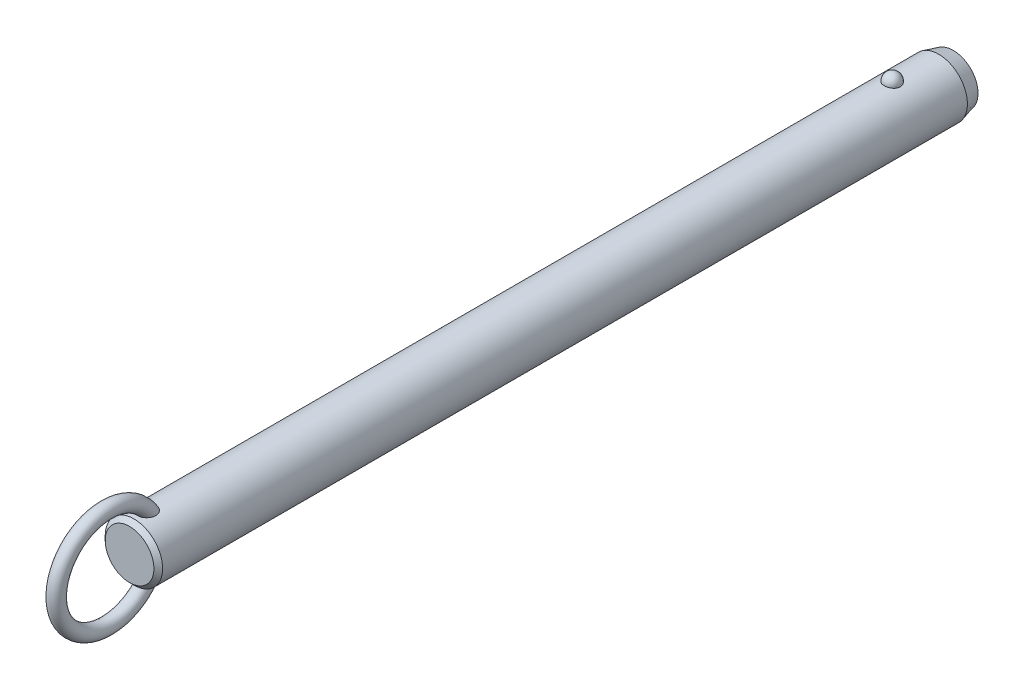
ISO-10303-21;
HEADER;
FILE_DESCRIPTION(('STEP AP214'),'2;1');
FILE_NAME('part.step','',(''),(''),'','','');
FILE_SCHEMA(('AUTOMOTIVE_DESIGN { 1 0 10303 214 1 1 1 1 }'));
ENDSEC;
DATA;
#1=APPLICATION_CONTEXT('core data for automotive mechanical design processes');
#2=APPLICATION_PROTOCOL_DEFINITION('international standard','automotive_design',2000,#1);
#3=PRODUCT_CONTEXT('',#1,'mechanical');
#4=PRODUCT('Part','Part','',(#3));
#5=PRODUCT_RELATED_PRODUCT_CATEGORY('part','',(#4));
#6=PRODUCT_DEFINITION_FORMATION('','',#4);
#7=PRODUCT_DEFINITION_CONTEXT('part definition',#1,'design');
#8=PRODUCT_DEFINITION('design','',#6,#7);
#9=PRODUCT_DEFINITION_SHAPE('','',#8);
#10=(LENGTH_UNIT() NAMED_UNIT(*) SI_UNIT(.MILLI.,.METRE.));
#11=(NAMED_UNIT(*) PLANE_ANGLE_UNIT() SI_UNIT($,.RADIAN.));
#12=(NAMED_UNIT(*) SI_UNIT($,.STERADIAN.) SOLID_ANGLE_UNIT());
#13=UNCERTAINTY_MEASURE_WITH_UNIT(LENGTH_MEASURE(1.E-05),#10,'distance_accuracy_value','');
#14=(GEOMETRIC_REPRESENTATION_CONTEXT(3) GLOBAL_UNCERTAINTY_ASSIGNED_CONTEXT((#13)) GLOBAL_UNIT_ASSIGNED_CONTEXT((#10,
#11,#12)) REPRESENTATION_CONTEXT('',''));
#15=CARTESIAN_POINT('',(0.,0.,0.));
#16=DIRECTION('',(0.,0.,1.));
#17=DIRECTION('',(1.,0.,0.));
#18=AXIS2_PLACEMENT_3D('',#15,#16,#17);
#19=CARTESIAN_POINT('',(0.,0.,198.1));
#20=DIRECTION('',(0.,0.,-1.));
#21=DIRECTION('',(-1.,0.,0.));
#22=AXIS2_PLACEMENT_3D('',#19,#20,#21);
#23=CYLINDRICAL_SURFACE('',#22,7.9);
#24=CARTESIAN_POINT('',(2.1785689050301,7.59367088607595,-2.20000000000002));
#25=CARTESIAN_POINT('',(2.17856679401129,7.59367269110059,-2.07701843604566));
#26=CARTESIAN_POINT('',(2.16853481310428,7.59657145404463,-1.95401006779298));
#27=CARTESIAN_POINT('',(2.12864689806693,7.607843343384,-1.71147811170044));
#28=CARTESIAN_POINT('',(2.09878338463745,7.61621856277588,-1.5919558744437));
#29=CARTESIAN_POINT('',(2.0199931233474,7.63749180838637,-1.35985638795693));
#30=CARTESIAN_POINT('',(1.97107475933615,7.6503878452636,-1.24727610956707));
#31=CARTESIAN_POINT('',(1.85539377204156,7.67926115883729,-1.03213234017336));
#32=CARTESIAN_POINT('',(1.78863158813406,7.69523835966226,-0.929568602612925));
#33=CARTESIAN_POINT('',(1.63856494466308,7.7285848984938,-0.73678633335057));
#34=CARTESIAN_POINT('',(1.55518140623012,7.7459606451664,-0.646630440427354));
#35=CARTESIAN_POINT('',(1.37422937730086,7.78009978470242,-0.481747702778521));
#36=CARTESIAN_POINT('',(1.27666086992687,7.79686317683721,-0.407020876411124));
#37=CARTESIAN_POINT('',(1.07024728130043,7.82786153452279,-0.275278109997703));
#38=CARTESIAN_POINT('',(0.961434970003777,7.84210353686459,-0.218212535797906));
#39=CARTESIAN_POINT('',(0.735351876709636,7.86652194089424,-0.123146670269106));
#40=CARTESIAN_POINT('',(0.618082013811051,7.87669878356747,-0.0851443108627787));
#41=CARTESIAN_POINT('',(0.380637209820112,7.89170521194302,-0.0298158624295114));
#42=CARTESIAN_POINT('',(0.260550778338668,7.89662650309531,-0.0121347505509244));
#43=CARTESIAN_POINT('',(0.0190117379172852,7.90090003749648,0.00324379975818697));
#44=CARTESIAN_POINT('',(-0.102440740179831,7.90025280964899,0.000943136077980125));
#45=CARTESIAN_POINT('',(-0.341452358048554,7.89351056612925,-0.0233955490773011));
#46=CARTESIAN_POINT('',(-0.459042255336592,7.88749257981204,-0.0451545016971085));
#47=CARTESIAN_POINT('',(-0.688796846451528,7.87075812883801,-0.107408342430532));
#48=CARTESIAN_POINT('',(-0.800961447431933,7.86004158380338,-0.14790355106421));
#49=CARTESIAN_POINT('',(-1.01743634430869,7.83497131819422,-0.246799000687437));
#50=CARTESIAN_POINT('',(-1.12169791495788,7.82059709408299,-0.305300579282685));
#51=CARTESIAN_POINT('',(-1.31891765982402,7.78976470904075,-0.43854939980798));
#52=CARTESIAN_POINT('',(-1.41187469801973,7.77330633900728,-0.513298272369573));
#53=CARTESIAN_POINT('',(-1.58577142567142,7.73972434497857,-0.678622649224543));
#54=CARTESIAN_POINT('',(-1.66645140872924,7.72259402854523,-0.769470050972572));
#55=CARTESIAN_POINT('',(-1.81161503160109,7.68983776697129,-0.963538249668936));
#56=CARTESIAN_POINT('',(-1.87609753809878,7.6742119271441,-1.0667599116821));
#57=CARTESIAN_POINT('',(-1.98790138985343,7.6460202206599,-1.28401170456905));
#58=CARTESIAN_POINT('',(-2.03501994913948,7.63349104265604,-1.39815107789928));
#59=CARTESIAN_POINT('',(-2.10986724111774,7.6131449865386,-1.6330178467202));
#60=CARTESIAN_POINT('',(-2.1375965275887,7.60532797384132,-1.75374505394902));
#61=CARTESIAN_POINT('',(-2.17289256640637,7.5953195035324,-1.99782562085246));
#62=CARTESIAN_POINT('',(-2.18054294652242,7.59310471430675,-2.12116592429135));
#63=CARTESIAN_POINT('',(-2.17572919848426,7.59448538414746,-2.36741799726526));
#64=CARTESIAN_POINT('',(-2.1632656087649,7.59808068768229,-2.49032977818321));
#65=CARTESIAN_POINT('',(-2.11865035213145,7.61064035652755,-2.73161015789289));
#66=CARTESIAN_POINT('',(-2.08659579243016,7.61957823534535,-2.84999812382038));
#67=CARTESIAN_POINT('',(-2.00367799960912,7.64179982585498,-3.07955956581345));
#68=CARTESIAN_POINT('',(-1.9528140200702,7.65508371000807,-3.19073275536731));
#69=CARTESIAN_POINT('',(-1.83321113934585,7.68460381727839,-3.40337899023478));
#70=CARTESIAN_POINT('',(-1.76437735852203,7.70085556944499,-3.5047965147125));
#71=CARTESIAN_POINT('',(-1.61069526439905,7.73445734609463,-3.69446912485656));
#72=CARTESIAN_POINT('',(-1.52584634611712,7.75180741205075,-3.78272371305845));
#73=CARTESIAN_POINT('',(-1.34198059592,7.78574608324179,-3.94393987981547));
#74=CARTESIAN_POINT('',(-1.24291308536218,7.80233167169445,-4.01684434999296));
#75=CARTESIAN_POINT('',(-1.03352039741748,7.83281625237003,-4.14489386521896));
#76=CARTESIAN_POINT('',(-0.92319600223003,7.84671543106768,-4.20004014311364));
#77=CARTESIAN_POINT('',(-0.695822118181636,7.87011575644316,-4.29042017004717));
#78=CARTESIAN_POINT('',(-0.578872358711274,7.87966903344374,-4.32589112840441));
#79=CARTESIAN_POINT('',(-0.340410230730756,7.8935652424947,-4.37692226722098));
#80=CARTESIAN_POINT('',(-0.218898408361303,7.89790879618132,-4.39248482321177));
#81=CARTESIAN_POINT('',(0.0228107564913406,7.90087453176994,-4.40314405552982));
#82=CARTESIAN_POINT('',(0.142990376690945,7.89960185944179,-4.39861683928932));
#83=CARTESIAN_POINT('',(0.380829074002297,7.89171262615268,-4.37008293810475));
#84=CARTESIAN_POINT('',(0.498488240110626,7.8850962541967,-4.34607694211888));
#85=CARTESIAN_POINT('',(0.727535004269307,7.86726442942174,-4.27939317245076));
#86=CARTESIAN_POINT('',(0.838944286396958,7.85606616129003,-4.23678512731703));
#87=CARTESIAN_POINT('',(1.05295421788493,7.83025654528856,-4.13408348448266));
#88=CARTESIAN_POINT('',(1.15555431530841,7.81564498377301,-4.07398879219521));
#89=CARTESIAN_POINT('',(1.35076763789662,7.7843022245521,-3.93687432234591));
#90=CARTESIAN_POINT('',(1.4432046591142,7.76754209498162,-3.85961036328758));
#91=CARTESIAN_POINT('',(1.6139111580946,7.73387857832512,-3.69076949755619));
#92=CARTESIAN_POINT('',(1.6921781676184,7.71697516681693,-3.59919010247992));
#93=CARTESIAN_POINT('',(1.83380875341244,7.6845643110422,-3.40247278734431));
#94=CARTESIAN_POINT('',(1.89689280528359,7.66908588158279,-3.29712873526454));
#95=CARTESIAN_POINT('',(2.0047823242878,7.64159441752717,-3.07707931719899));
#96=CARTESIAN_POINT('',(2.0495945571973,7.62958010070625,-2.96237743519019));
#97=CARTESIAN_POINT('',(2.11580183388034,7.61146617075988,-2.74040519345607));
#98=CARTESIAN_POINT('',(2.13929812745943,7.60484503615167,-2.63379846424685));
#99=CARTESIAN_POINT('',(2.17068242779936,7.59594664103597,-2.4181348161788));
#100=CARTESIAN_POINT('',(2.17857077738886,7.59366928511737,-2.30907795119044));
#101=CARTESIAN_POINT('',(2.1785689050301,7.59367088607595,-2.20000000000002));
#102=B_SPLINE_CURVE_WITH_KNOTS('',3,(#24,#25,#26,#27,#28,#29,#30,#31,#32,#33,#34,#35,#36,#37,
#38,#39,#40,#41,#42,#43,#44,#45,#46,#47,#48,#49,#50,#51,#52,#53,#54,#55,#56,#57,#58,#59,#60,#61,
#62,#63,#64,#65,#66,#67,#68,#69,#70,#71,#72,#73,#74,#75,#76,#77,#78,#79,#80,#81,#82,#83,#84,#85,
#86,#87,#88,#89,#90,#91,#92,#93,#94,#95,#96,#97,#98,#99,#100,#101),.UNSPECIFIED.,.T.,.F.,(4,2,2,
2,2,2,2,2,2,2,2,2,2,2,2,2,2,2,2,2,2,2,2,2,2,2,2,2,2,2,2,2,2,2,2,2,2,2,4),(0.,0.368552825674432,
0.737246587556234,1.10577831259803,1.4743009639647,1.8446206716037,2.21494081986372,
2.5842105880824,2.95344028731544,3.31611630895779,3.67875788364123,4.03628044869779,
4.39380913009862,4.75338791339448,5.11300280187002,5.47939989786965,5.8458226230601,
6.21639834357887,6.58696347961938,6.95598276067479,7.32499216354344,7.69218715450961,
8.0593967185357,8.42858578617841,8.79778880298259,9.16834203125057,9.5388695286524,
9.90482699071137,10.2707407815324,10.6298333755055,10.9889132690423,11.3466585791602,
11.7044262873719,12.0676511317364,12.4309391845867,12.8004764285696,13.1698767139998,
13.4967701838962,13.8236564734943),.UNSPECIFIED.);
#103=CARTESIAN_POINT('',(2.1785689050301,7.59367088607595,-2.20000000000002));
#104=VERTEX_POINT('',#103);
#105=EDGE_CURVE('E41',#104,#104,#102,.T.);
#106=ORIENTED_EDGE('',*,*,#105,.T.);
#107=EDGE_LOOP('',(#106));
#108=FACE_BOUND('',#107,.T.);
#109=CARTESIAN_POINT('',(0.,0.,206.42));
#110=DIRECTION('',(0.,0.,1.));
#111=DIRECTION('',(1.,0.,0.));
#112=AXIS2_PLACEMENT_3D('',#109,#110,#111);
#113=CIRCLE('',#112,7.9);
#114=CARTESIAN_POINT('',(7.9,0.,206.42));
#115=VERTEX_POINT('',#114);
#116=EDGE_CURVE('E10',#115,#115,#113,.F.);
#117=ORIENTED_EDGE('',*,*,#116,.T.);
#118=EDGE_LOOP('',(#117));
#119=FACE_BOUND('',#118,.T.);
#120=CARTESIAN_POINT('',(-0.630969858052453,-7.87476203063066,200.312432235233));
#121=CARTESIAN_POINT('',(-0.734180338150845,-7.86648998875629,200.347285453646));
#122=CARTESIAN_POINT('',(-0.834476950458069,-7.85639291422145,200.390816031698));
#123=CARTESIAN_POINT('',(-1.0262035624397,-7.83366343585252,200.494094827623));
#124=CARTESIAN_POINT('',(-1.1176141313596,-7.82102565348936,200.553877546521));
#125=CARTESIAN_POINT('',(-1.28877277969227,-7.79464922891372,200.687839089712));
#126=CARTESIAN_POINT('',(-1.36854014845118,-7.78091246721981,200.761993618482));
#127=CARTESIAN_POINT('',(-1.5146152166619,-7.75380398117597,200.922494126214));
#128=CARTESIAN_POINT('',(-1.58092966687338,-7.74043207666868,201.008833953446));
#129=CARTESIAN_POINT('',(-1.70019064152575,-7.7151252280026,201.192978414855));
#130=CARTESIAN_POINT('',(-1.75284037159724,-7.70322473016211,201.290979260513));
#131=CARTESIAN_POINT('',(-1.84263464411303,-7.68224112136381,201.494102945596));
#132=CARTESIAN_POINT('',(-1.87977299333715,-7.6731591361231,201.599228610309));
#133=CARTESIAN_POINT('',(-1.94152728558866,-7.65777930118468,201.823284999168));
#134=CARTESIAN_POINT('',(-1.96475471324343,-7.65179654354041,201.942616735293));
#135=CARTESIAN_POINT('',(-1.99449499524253,-7.64409642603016,202.18342986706));
#136=CARTESIAN_POINT('',(-2.0010005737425,-7.64238092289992,202.304912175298));
#137=CARTESIAN_POINT('',(-1.99856014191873,-7.64302120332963,202.568340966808));
#138=CARTESIAN_POINT('',(-1.98680021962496,-7.64611845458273,202.71025654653));
#139=CARTESIAN_POINT('',(-1.94457772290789,-7.65696186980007,202.991118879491));
#140=CARTESIAN_POINT('',(-1.91409393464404,-7.66471330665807,203.130062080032));
#141=CARTESIAN_POINT('',(-1.82768670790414,-7.68582947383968,203.431939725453));
#142=CARTESIAN_POINT('',(-1.76772963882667,-7.70003779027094,203.593686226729));
#143=CARTESIAN_POINT('',(-1.65998501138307,-7.72371550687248,203.827695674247));
#144=CARTESIAN_POINT('',(-1.621079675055,-7.73200670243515,203.904297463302));
#145=CARTESIAN_POINT('',(-1.53727726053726,-7.74910377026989,204.054079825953));
#146=CARTESIAN_POINT('',(-1.49238215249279,-7.75790947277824,204.127261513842));
#147=CARTESIAN_POINT('',(-1.37397050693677,-7.77993338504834,204.30288382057));
#148=CARTESIAN_POINT('',(-1.29690364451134,-7.79328473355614,204.402955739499));
#149=CARTESIAN_POINT('',(-1.12885487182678,-7.81939266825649,204.590714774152));
#150=CARTESIAN_POINT('',(-1.03789926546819,-7.83215032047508,204.678424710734));
#151=CARTESIAN_POINT('',(-0.869532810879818,-7.85231710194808,204.813414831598));
#152=CARTESIAN_POINT('',(-0.795716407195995,-7.86021093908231,204.865076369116));
#153=CARTESIAN_POINT('',(-0.640813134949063,-7.87434920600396,204.956381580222));
#154=CARTESIAN_POINT('',(-0.559737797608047,-7.88059619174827,204.99604389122));
#155=CARTESIAN_POINT('',(-0.406456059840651,-7.88984116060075,205.054300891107));
#156=CARTESIAN_POINT('',(-0.335227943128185,-7.89321892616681,205.075384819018));
#157=CARTESIAN_POINT('',(-0.190193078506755,-7.89804235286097,205.10541418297));
#158=CARTESIAN_POINT('',(-0.116388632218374,-7.89948969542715,205.114370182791));
#159=CARTESIAN_POINT('',(0.0318414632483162,-7.90028409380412,205.119291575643));
#160=CARTESIAN_POINT('',(0.106268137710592,-7.89962640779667,205.115227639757));
#161=CARTESIAN_POINT('',(0.253290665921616,-7.8962818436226,205.094461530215));
#162=CARTESIAN_POINT('',(0.325885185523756,-7.8935935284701,205.077750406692));
#163=CARTESIAN_POINT('',(0.481441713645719,-7.88577340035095,205.028738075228));
#164=CARTESIAN_POINT('',(0.563611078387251,-7.88026321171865,204.994005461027));
#165=CARTESIAN_POINT('',(0.721129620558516,-7.86741729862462,204.911796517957));
#166=CARTESIAN_POINT('',(0.79646633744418,-7.86007832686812,204.864297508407));
#167=CARTESIAN_POINT('',(0.971456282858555,-7.84073285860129,204.736513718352));
#168=CARTESIAN_POINT('',(1.06719686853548,-7.82809461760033,204.651004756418));
#169=CARTESIAN_POINT('',(1.24418921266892,-7.80192439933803,204.466232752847));
#170=CARTESIAN_POINT('',(1.32540832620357,-7.78839049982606,204.366939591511));
#171=CARTESIAN_POINT('',(1.45199971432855,-7.76559693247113,204.189576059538));
#172=CARTESIAN_POINT('',(1.50085649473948,-7.75626094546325,204.113954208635));
#173=CARTESIAN_POINT('',(1.59197749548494,-7.73807279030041,203.958742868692));
#174=CARTESIAN_POINT('',(1.63423919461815,-7.72922080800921,203.879151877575));
#175=CARTESIAN_POINT('',(1.71222612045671,-7.71231959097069,203.716664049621));
#176=CARTESIAN_POINT('',(1.74794516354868,-7.70427111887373,203.633764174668));
#177=CARTESIAN_POINT('',(1.81270113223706,-7.68929240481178,203.465296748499));
#178=CARTESIAN_POINT('',(1.84173789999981,-7.68236218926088,203.379729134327));
#179=CARTESIAN_POINT('',(1.89322698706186,-7.6698375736,203.20528702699));
#180=CARTESIAN_POINT('',(1.91558744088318,-7.66426199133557,203.116383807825));
#181=CARTESIAN_POINT('',(1.95281367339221,-7.65485915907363,202.936969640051));
#182=CARTESIAN_POINT('',(1.96767946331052,-7.65103190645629,202.846458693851));
#183=CARTESIAN_POINT('',(2.0002145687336,-7.64262981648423,202.573732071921));
#184=CARTESIAN_POINT('',(2.00600691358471,-7.6410871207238,202.389709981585));
#185=CARTESIAN_POINT('',(1.98445334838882,-7.64669564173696,202.076501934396));
#186=CARTESIAN_POINT('',(1.96607186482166,-7.65149688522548,201.946618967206));
#187=CARTESIAN_POINT('',(1.90884967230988,-7.66597624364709,201.691632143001));
#188=CARTESIAN_POINT('',(1.87002101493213,-7.67565148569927,201.566525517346));
#189=CARTESIAN_POINT('',(1.77063986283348,-7.69918471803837,201.32454013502));
#190=CARTESIAN_POINT('',(1.70993724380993,-7.71307150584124,201.207725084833));
#191=CARTESIAN_POINT('',(1.56733070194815,-7.74330306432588,200.988144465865));
#192=CARTESIAN_POINT('',(1.48543692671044,-7.75964665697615,200.885372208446));
#193=CARTESIAN_POINT('',(1.31346177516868,-7.79047523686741,200.709380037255));
#194=CARTESIAN_POINT('',(1.22547278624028,-7.80495298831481,200.634106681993));
#195=CARTESIAN_POINT('',(1.03724352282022,-7.83218597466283,200.500486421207));
#196=CARTESIAN_POINT('',(0.93700840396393,-7.84494192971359,200.442132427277));
#197=CARTESIAN_POINT('',(0.733599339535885,-7.86649045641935,200.347027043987));
#198=CARTESIAN_POINT('',(0.630941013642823,-7.87547134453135,200.309210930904));
#199=CARTESIAN_POINT('',(0.420465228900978,-7.88950708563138,200.251116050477));
#200=CARTESIAN_POINT('',(0.312645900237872,-7.89456050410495,200.23084369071));
#201=CARTESIAN_POINT('',(0.0960869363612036,-7.9001518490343,200.208455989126));
#202=CARTESIAN_POINT('',(-0.0126341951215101,-7.90073226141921,200.206169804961));
#203=CARTESIAN_POINT('',(-0.228766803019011,-7.89742350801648,200.219367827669));
#204=CARTESIAN_POINT('',(-0.336180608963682,-7.89354403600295,200.234813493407));
#205=CARTESIAN_POINT('',(-0.473410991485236,-7.88586871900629,200.266217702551));
#206=CARTESIAN_POINT('',(-0.50525779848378,-7.88388984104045,200.274354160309));
#207=CARTESIAN_POINT('',(-0.56848128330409,-7.87958326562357,200.292208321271));
#208=CARTESIAN_POINT('',(-0.59985795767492,-7.87725556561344,200.301926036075));
#209=CARTESIAN_POINT('',(-0.630969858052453,-7.87476203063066,200.312432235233));
#210=B_SPLINE_CURVE_WITH_KNOTS('',3,(#120,#121,#122,#123,#124,#125,#126,#127,#128,#129,#130,
#131,#132,#133,#134,#135,#136,#137,#138,#139,#140,#141,#142,#143,#144,#145,#146,#147,#148,#149,
#150,#151,#152,#153,#154,#155,#156,#157,#158,#159,#160,#161,#162,#163,#164,#165,#166,#167,#168,
#169,#170,#171,#172,#173,#174,#175,#176,#177,#178,#179,#180,#181,#182,#183,#184,#185,#186,#187,
#188,#189,#190,#191,#192,#193,#194,#195,#196,#197,#198,#199,#200,#201,#202,#203,#204,#205,#206,
#207,#208,#209),.UNSPECIFIED.,.T.,.F.,(4,2,2,2,2,2,2,2,2,2,2,2,2,2,2,2,2,2,2,2,2,2,2,2,2,2,2,2,
2,2,2,2,2,2,2,2,2,2,2,2,2,2,2,2,4),(0.,0.327622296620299,0.655945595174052,0.983718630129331,
1.31132677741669,1.64554655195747,1.97989964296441,2.34365728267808,2.70757317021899,
3.13333684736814,3.55958380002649,4.07655306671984,4.33527897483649,4.59391999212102,
4.97382437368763,5.353017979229,5.62348245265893,5.89352465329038,6.11565959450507,
6.33760092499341,6.56004255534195,6.78264174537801,7.04930844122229,7.31645206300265,
7.70130871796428,8.08701995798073,8.35824509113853,8.6295736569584,8.9011573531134,
9.17274746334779,9.44791855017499,9.72308922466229,10.2715298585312,10.6638393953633,
11.0559179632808,11.4507403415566,11.8453740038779,12.1936425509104,12.5417649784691,
12.8695063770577,13.1973674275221,13.5221104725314,13.8461490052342,13.9449071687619,
14.0436660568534),.UNSPECIFIED.);
#211=CARTESIAN_POINT('',(-0.630969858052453,-7.87476203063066,200.312432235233));
#212=VERTEX_POINT('',#211);
#213=EDGE_CURVE('E60',#212,#212,#210,.T.);
#214=ORIENTED_EDGE('',*,*,#213,.T.);
#215=EDGE_LOOP('',(#214));
#216=FACE_BOUND('',#215,.T.);
#217=CARTESIAN_POINT('',(-0.630969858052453,7.87476203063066,200.312432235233));
#218=CARTESIAN_POINT('',(-0.528918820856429,7.88293636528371,200.277979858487));
#219=CARTESIAN_POINT('',(-0.423745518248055,7.88934810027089,200.251915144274));
#220=CARTESIAN_POINT('',(-0.210236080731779,7.8979273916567,200.217282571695));
#221=CARTESIAN_POINT('',(-0.10189380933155,7.90008607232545,200.208751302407));
#222=CARTESIAN_POINT('',(0.11466056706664,7.89990877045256,200.209457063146));
#223=CARTESIAN_POINT('',(0.222872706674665,7.89757640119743,200.21867980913));
#224=CARTESIAN_POINT('',(0.436107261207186,7.88867538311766,200.254652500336));
#225=CARTESIAN_POINT('',(0.54113114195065,7.8821087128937,200.28139425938));
#226=CARTESIAN_POINT('',(0.745085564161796,7.86545130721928,200.351756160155));
#227=CARTESIAN_POINT('',(0.844015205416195,7.85536005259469,200.395378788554));
#228=CARTESIAN_POINT('',(1.03299167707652,7.83275153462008,200.498379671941));
#229=CARTESIAN_POINT('',(1.12303841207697,7.8202342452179,200.557758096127));
#230=CARTESIAN_POINT('',(1.29214734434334,7.79408219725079,200.690864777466));
#231=CARTESIAN_POINT('',(1.37116907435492,7.78044359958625,200.764643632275));
#232=CARTESIAN_POINT('',(1.51597677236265,7.75353170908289,200.924235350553));
#233=CARTESIAN_POINT('',(1.58176261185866,7.74025841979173,201.010048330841));
#234=CARTESIAN_POINT('',(1.70057386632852,7.71504069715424,201.193644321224));
#235=CARTESIAN_POINT('',(1.75320073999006,7.7031425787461,201.291690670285));
#236=CARTESIAN_POINT('',(1.8429376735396,7.68216822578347,201.494893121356));
#237=CARTESIAN_POINT('',(1.88004278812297,7.67309289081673,201.600051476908));
#238=CARTESIAN_POINT('',(1.9417232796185,7.6577294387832,201.824167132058));
#239=CARTESIAN_POINT('',(1.96491037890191,7.65175648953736,201.943524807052));
#240=CARTESIAN_POINT('',(1.9945689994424,7.64407702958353,202.184384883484));
#241=CARTESIAN_POINT('',(2.00103304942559,7.64237242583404,202.30588821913));
#242=CARTESIAN_POINT('',(1.99850166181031,7.64303650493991,202.569368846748));
#243=CARTESIAN_POINT('',(1.98669038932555,7.64614714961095,202.711314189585));
#244=CARTESIAN_POINT('',(1.94436120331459,7.65701701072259,202.992228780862));
#245=CARTESIAN_POINT('',(1.91382203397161,7.66478150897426,203.131194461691));
#246=CARTESIAN_POINT('',(1.82728754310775,7.68592483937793,203.433111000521));
#247=CARTESIAN_POINT('',(1.76725778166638,7.70014685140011,203.594872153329));
#248=CARTESIAN_POINT('',(1.65939700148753,7.72384204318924,203.828891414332));
#249=CARTESIAN_POINT('',(1.62045187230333,7.73213852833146,203.905494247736));
#250=CARTESIAN_POINT('',(1.5365668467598,7.74924489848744,204.055273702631));
#251=CARTESIAN_POINT('',(1.49162892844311,7.75805461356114,204.128451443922));
#252=CARTESIAN_POINT('',(1.37317698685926,7.78007342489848,204.303952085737));
#253=CARTESIAN_POINT('',(1.29612360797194,7.79341423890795,204.403911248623));
#254=CARTESIAN_POINT('',(1.12812043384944,7.81949839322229,204.59145083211));
#255=CARTESIAN_POINT('',(1.03719688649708,7.83224280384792,204.679054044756));
#256=CARTESIAN_POINT('',(0.868871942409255,7.85239026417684,204.81389715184));
#257=CARTESIAN_POINT('',(0.795056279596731,7.86027769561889,204.865511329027));
#258=CARTESIAN_POINT('',(0.640160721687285,7.87440222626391,204.956720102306));
#259=CARTESIAN_POINT('',(0.559092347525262,7.88064188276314,204.996333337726));
#260=CARTESIAN_POINT('',(0.405820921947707,7.8898738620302,205.054505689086));
#261=CARTESIAN_POINT('',(0.334594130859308,7.89324577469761,205.075552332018));
#262=CARTESIAN_POINT('',(0.189568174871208,7.89805733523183,205.105507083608));
#263=CARTESIAN_POINT('',(0.115771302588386,7.89949866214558,205.114425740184));
#264=CARTESIAN_POINT('',(-0.0324359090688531,7.90028156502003,205.11927589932));
#265=CARTESIAN_POINT('',(-0.106847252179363,7.89961843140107,205.115178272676));
#266=CARTESIAN_POINT('',(-0.253834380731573,7.8962642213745,205.094351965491));
#267=CARTESIAN_POINT('',(-0.326408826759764,7.89357170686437,205.077614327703));
#268=CARTESIAN_POINT('',(-0.481962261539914,7.88574179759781,205.028539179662));
#269=CARTESIAN_POINT('',(-0.564145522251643,7.88022507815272,204.993763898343));
#270=CARTESIAN_POINT('',(-0.721685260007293,7.86736646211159,204.911468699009));
#271=CARTESIAN_POINT('',(-0.797029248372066,7.8600213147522,204.863926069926));
#272=CARTESIAN_POINT('',(-0.972044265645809,7.84066026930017,204.736026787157));
#273=CARTESIAN_POINT('',(-1.06779803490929,7.828012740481,204.650443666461));
#274=CARTESIAN_POINT('',(-1.24480531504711,7.80182621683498,204.465522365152));
#275=CARTESIAN_POINT('',(-1.32602618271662,7.78828530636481,204.366154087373));
#276=CARTESIAN_POINT('',(-1.4525983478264,7.76548487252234,204.188680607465));
#277=CARTESIAN_POINT('',(-1.50143856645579,7.75614818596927,204.113025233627));
#278=CARTESIAN_POINT('',(-1.59252410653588,7.73796020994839,203.957748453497));
#279=CARTESIAN_POINT('',(-1.63476690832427,7.72910910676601,203.878125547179));
#280=CARTESIAN_POINT('',(-1.71271318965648,7.71221133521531,203.715575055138));
#281=CARTESIAN_POINT('',(-1.74841047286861,7.70416543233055,203.632644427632));
#282=CARTESIAN_POINT('',(-1.81311929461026,7.6891937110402,203.464116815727));
#283=CARTESIAN_POINT('',(-1.84213067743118,7.68226791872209,203.378519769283));
#284=CARTESIAN_POINT('',(-1.89356259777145,7.66975461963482,203.204025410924));
#285=CARTESIAN_POINT('',(-1.91589165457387,7.66418586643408,203.115099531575));
#286=CARTESIAN_POINT('',(-1.9530507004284,7.65479859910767,202.935642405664));
#287=CARTESIAN_POINT('',(-1.96788069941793,7.65098008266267,202.845111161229));
#288=CARTESIAN_POINT('',(-2.00030078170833,7.64260704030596,202.572327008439));
#289=CARTESIAN_POINT('',(-2.00600576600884,7.64108760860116,202.388271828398));
#290=CARTESIAN_POINT('',(-1.9842848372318,7.64673945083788,202.075080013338));
#291=CARTESIAN_POINT('',(-1.96583698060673,7.65155751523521,201.945240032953));
#292=CARTESIAN_POINT('',(-1.90848948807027,7.66606613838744,201.690361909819));
#293=CARTESIAN_POINT('',(-1.86960376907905,7.67575338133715,201.565320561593));
#294=CARTESIAN_POINT('',(-1.77013421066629,7.6993013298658,201.323500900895));
#295=CARTESIAN_POINT('',(-1.70940488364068,7.71318991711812,201.206784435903));
#296=CARTESIAN_POINT('',(-1.56672953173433,7.74342495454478,200.987340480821));
#297=CARTESIAN_POINT('',(-1.48478316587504,7.75977144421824,200.88461321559));
#298=CARTESIAN_POINT('',(-1.31266325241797,7.79061163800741,200.708643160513));
#299=CARTESIAN_POINT('',(-1.22456383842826,7.80509908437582,200.633358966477));
#300=CARTESIAN_POINT('',(-1.03622400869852,7.83231881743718,200.499865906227));
#301=CARTESIAN_POINT('',(-0.936015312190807,7.84505551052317,200.441613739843));
#302=CARTESIAN_POINT('',(-0.798824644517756,7.85957802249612,200.377540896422));
#303=CARTESIAN_POINT('',(-0.765787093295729,7.86286821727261,200.363224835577));
#304=CARTESIAN_POINT('',(-0.698939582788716,7.86909211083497,200.336436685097));
#305=CARTESIAN_POINT('',(-0.66512963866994,7.8720258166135,200.323964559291));
#306=CARTESIAN_POINT('',(-0.630969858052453,7.87476203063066,200.312432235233));
#307=B_SPLINE_CURVE_WITH_KNOTS('',3,(#217,#218,#219,#220,#221,#222,#223,#224,#225,#226,#227,
#228,#229,#230,#231,#232,#233,#234,#235,#236,#237,#238,#239,#240,#241,#242,#243,#244,#245,#246,
#247,#248,#249,#250,#251,#252,#253,#254,#255,#256,#257,#258,#259,#260,#261,#262,#263,#264,#265,
#266,#267,#268,#269,#270,#271,#272,#273,#274,#275,#276,#277,#278,#279,#280,#281,#282,#283,#284,
#285,#286,#287,#288,#289,#290,#291,#292,#293,#294,#295,#296,#297,#298,#299,#300,#301,#302,#303,
#304,#305,#306),.UNSPECIFIED.,.T.,.F.,(4,2,2,2,2,2,2,2,2,2,2,2,2,2,2,2,2,2,2,2,2,2,2,2,2,2,2,2,
2,2,2,2,2,2,2,2,2,2,2,2,2,2,2,2,4),(0.,0.323920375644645,0.648516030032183,0.972850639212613,
1.29703380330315,1.62126473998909,1.94549915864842,2.27089401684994,2.5962920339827,
2.93059633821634,3.26500707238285,3.6288164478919,3.99278833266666,4.41865421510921,
4.84500434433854,5.36209210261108,5.62087589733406,5.87957448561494,6.25918598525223,
6.63808782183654,6.90846748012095,7.17842501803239,7.40052350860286,7.6224287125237,
7.84483086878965,8.06739077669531,8.33414615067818,8.6013792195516,8.98641454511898,
9.37230415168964,9.64358673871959,9.91497268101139,10.1866142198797,10.4582620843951,
10.7334745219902,11.008686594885,11.5572126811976,11.9494246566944,12.3413699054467,
12.7359755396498,13.1305875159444,13.4791770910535,13.82687259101,13.9353013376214,
14.0437279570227),.UNSPECIFIED.);
#308=CARTESIAN_POINT('',(-0.630969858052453,7.87476203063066,200.312432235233));
#309=VERTEX_POINT('',#308);
#310=EDGE_CURVE('E68',#309,#309,#307,.T.);
#311=ORIENTED_EDGE('',*,*,#310,.T.);
#312=EDGE_LOOP('',(#311));
#313=FACE_BOUND('',#312,.T.);
#314=CARTESIAN_POINT('',(0.,0.,-15.));
#315=DIRECTION('',(0.,0.,-1.));
#316=DIRECTION('',(-1.,0.,0.));
#317=AXIS2_PLACEMENT_3D('',#314,#315,#316);
#318=CIRCLE('',#317,7.9);
#319=CARTESIAN_POINT('',(-7.9,0.,-15.));
#320=VERTEX_POINT('',#319);
#321=EDGE_CURVE('E57',#320,#320,#318,.F.);
#322=ORIENTED_EDGE('',*,*,#321,.T.);
#323=EDGE_LOOP('',(#322));
#324=FACE_BOUND('',#323,.T.);
#325=ADVANCED_FACE('F37',(#108,#119,#216,#313,#324),#23,.T.);
#326=CARTESIAN_POINT('',(0.,0.,-19.));
#327=DIRECTION('',(0.,0.,-1.));
#328=DIRECTION('',(-1.,0.,0.));
#329=AXIS2_PLACEMENT_3D('',#326,#327,#328);
#330=PLANE('',#329);
#331=CARTESIAN_POINT('',(0.,0.,-19.));
#332=DIRECTION('',(0.,0.,-1.));
#333=DIRECTION('',(-1.,0.,0.));
#334=AXIS2_PLACEMENT_3D('',#331,#332,#333);
#335=CIRCLE('',#334,6.82820323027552);
#336=CARTESIAN_POINT('',(-6.82820323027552,0.,-19.));
#337=VERTEX_POINT('',#336);
#338=EDGE_CURVE('E67',#337,#337,#335,.T.);
#339=ORIENTED_EDGE('',*,*,#338,.T.);
#340=EDGE_LOOP('',(#339));
#341=FACE_BOUND('',#340,.T.);
#342=ADVANCED_FACE('F86',(#341),#330,.T.);
#343=CARTESIAN_POINT('',(0.,0.,-19.));
#344=DIRECTION('',(0.,0.,1.));
#345=DIRECTION('',(1.,0.,0.));
#346=AXIS2_PLACEMENT_3D('',#343,#344,#345);
#347=CONICAL_SURFACE('',#346,6.82820323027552,0.261799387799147);
#348=ORIENTED_EDGE('',*,*,#321,.F.);
#349=EDGE_LOOP('',(#348));
#350=FACE_BOUND('',#349,.T.);
#351=ORIENTED_EDGE('',*,*,#338,.F.);
#352=EDGE_LOOP('',(#351));
#353=FACE_BOUND('',#352,.T.);
#354=ADVANCED_FACE('F84',(#350,#353),#347,.T.);
#355=CARTESIAN_POINT('',(0.,0.,207.62));
#356=DIRECTION('',(0.,0.,1.));
#357=DIRECTION('',(1.,0.,0.));
#358=AXIS2_PLACEMENT_3D('',#355,#356,#357);
#359=PLANE('',#358);
#360=CARTESIAN_POINT('',(0.,0.,207.62));
#361=DIRECTION('',(0.,0.,1.));
#362=DIRECTION('',(1.,0.,0.));
#363=AXIS2_PLACEMENT_3D('',#360,#361,#362);
#364=CIRCLE('',#363,6.69999999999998);
#365=CARTESIAN_POINT('',(6.69999999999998,0.,207.62));
#366=VERTEX_POINT('',#365);
#367=EDGE_CURVE('E50',#366,#366,#364,.T.);
#368=ORIENTED_EDGE('',*,*,#367,.T.);
#369=EDGE_LOOP('',(#368));
#370=FACE_BOUND('',#369,.T.);
#371=ADVANCED_FACE('F78',(#370),#359,.T.);
#372=CARTESIAN_POINT('',(0.,0.,213.95));
#373=DIRECTION('',(1.,0.,0.));
#374=DIRECTION('',(0.,0.,-1.));
#375=AXIS2_PLACEMENT_3D('',#372,#373,#374);
#376=TOROIDAL_SURFACE('',#375,13.85,2.);
#377=ORIENTED_EDGE('',*,*,#310,.F.);
#378=EDGE_LOOP('',(#377));
#379=FACE_BOUND('',#378,.T.);
#380=ORIENTED_EDGE('',*,*,#213,.F.);
#381=EDGE_LOOP('',(#380));
#382=FACE_BOUND('',#381,.T.);
#383=ADVANCED_FACE('F74',(#379,#382),#376,.T.);
#384=CARTESIAN_POINT('',(0.,0.,207.62));
#385=DIRECTION('',(0.,0.,-1.));
#386=DIRECTION('',(-1.,0.,0.));
#387=AXIS2_PLACEMENT_3D('',#384,#385,#386);
#388=CONICAL_SURFACE('',#387,6.69999999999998,0.78539816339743);
#389=ORIENTED_EDGE('',*,*,#116,.F.);
#390=EDGE_LOOP('',(#389));
#391=FACE_BOUND('',#390,.T.);
#392=ORIENTED_EDGE('',*,*,#367,.F.);
#393=EDGE_LOOP('',(#392));
#394=FACE_BOUND('',#393,.T.);
#395=ADVANCED_FACE('F39',(#391,#394),#388,.T.);
#396=CARTESIAN_POINT('',(0.,7.9,-2.20000000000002));
#397=DIRECTION('',(0.,1.,0.));
#398=DIRECTION('',(0.,0.,-1.));
#399=AXIS2_PLACEMENT_3D('',#396,#397,#398);
#400=SPHERICAL_SURFACE('',#399,2.2);
#401=ORIENTED_EDGE('',*,*,#105,.F.);
#402=EDGE_LOOP('',(#401));
#403=FACE_BOUND('',#402,.T.);
#404=ADVANCED_FACE('F80',(#403),#400,.T.);
#405=CLOSED_SHELL('',(#325,#342,#354,#371,#383,#395,#404));
#406=MANIFOLD_SOLID_BREP('B2',#405);
#407=ADVANCED_BREP_SHAPE_REPRESENTATION('',(#18,#406),#14);
#408=SHAPE_DEFINITION_REPRESENTATION(#9,#407);
ENDSEC;
END-ISO-10303-21;
